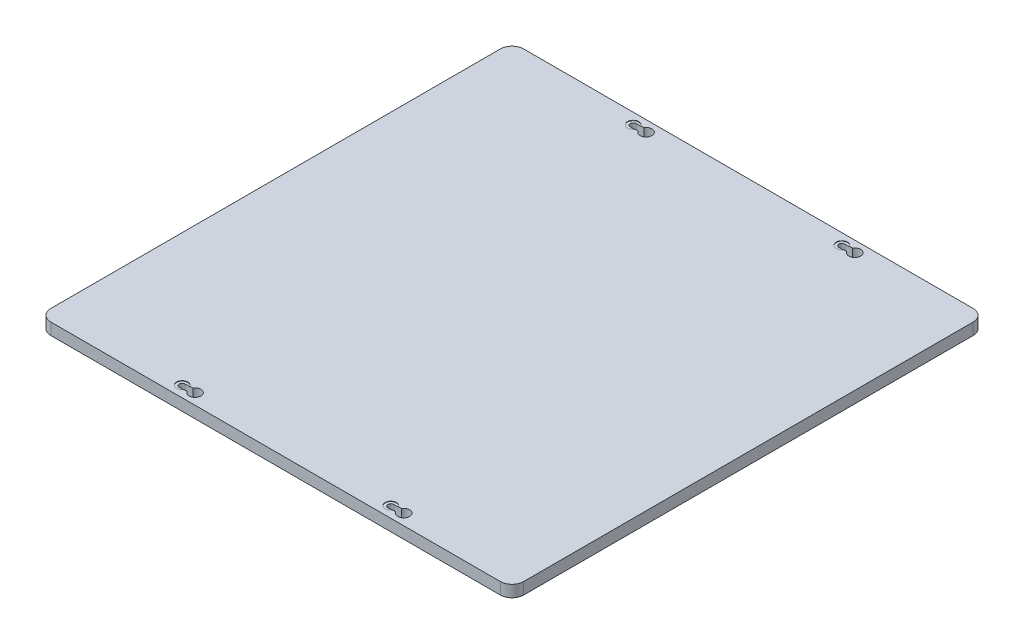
ISO-10303-21;
HEADER;
FILE_DESCRIPTION(('STEP AP214'),'2;1');
FILE_NAME('part.step','',(''),(''),'','','');
FILE_SCHEMA(('AUTOMOTIVE_DESIGN { 1 0 10303 214 1 1 1 1 }'));
ENDSEC;
DATA;
#1=APPLICATION_CONTEXT('core data for automotive mechanical design processes');
#2=APPLICATION_PROTOCOL_DEFINITION('international standard','automotive_design',2000,#1);
#3=PRODUCT_CONTEXT('',#1,'mechanical');
#4=PRODUCT('Part','Part','',(#3));
#5=PRODUCT_RELATED_PRODUCT_CATEGORY('part','',(#4));
#6=PRODUCT_DEFINITION_FORMATION('','',#4);
#7=PRODUCT_DEFINITION_CONTEXT('part definition',#1,'design');
#8=PRODUCT_DEFINITION('design','',#6,#7);
#9=PRODUCT_DEFINITION_SHAPE('','',#8);
#10=(LENGTH_UNIT() NAMED_UNIT(*) SI_UNIT(.MILLI.,.METRE.));
#11=(NAMED_UNIT(*) PLANE_ANGLE_UNIT() SI_UNIT($,.RADIAN.));
#12=(NAMED_UNIT(*) SI_UNIT($,.STERADIAN.) SOLID_ANGLE_UNIT());
#13=UNCERTAINTY_MEASURE_WITH_UNIT(LENGTH_MEASURE(1.E-05),#10,'distance_accuracy_value','');
#14=(GEOMETRIC_REPRESENTATION_CONTEXT(3) GLOBAL_UNCERTAINTY_ASSIGNED_CONTEXT((#13)) GLOBAL_UNIT_ASSIGNED_CONTEXT((#10,
#11,#12)) REPRESENTATION_CONTEXT('',''));
#15=CARTESIAN_POINT('',(0.,0.,0.));
#16=DIRECTION('',(0.,0.,1.));
#17=DIRECTION('',(1.,0.,0.));
#18=AXIS2_PLACEMENT_3D('',#15,#16,#17);
#19=CARTESIAN_POINT('',(-115.,-3.,115.));
#20=DIRECTION('',(0.,1.,0.));
#21=DIRECTION('',(0.,0.,1.));
#22=AXIS2_PLACEMENT_3D('',#19,#20,#21);
#23=CYLINDRICAL_SURFACE('',#22,5.99999999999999);
#24=CARTESIAN_POINT('',(-115.,3.,115.));
#25=DIRECTION('',(0.,1.,0.));
#26=DIRECTION('',(0.,0.,1.));
#27=AXIS2_PLACEMENT_3D('',#24,#25,#26);
#28=CIRCLE('',#27,5.99999999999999);
#29=CARTESIAN_POINT('',(-121.,3.,115.));
#30=VERTEX_POINT('',#29);
#31=CARTESIAN_POINT('',(-115.,3.,121.));
#32=VERTEX_POINT('',#31);
#33=EDGE_CURVE('E280',#30,#32,#28,.T.);
#34=ORIENTED_EDGE('',*,*,#33,.F.);
#35=DIRECTION('',(0.,1.,0.));
#36=VECTOR('',#35,1.);
#37=CARTESIAN_POINT('',(-121.,-3.,115.));
#38=LINE('',#37,#36);
#39=CARTESIAN_POINT('',(-121.,-3.,115.));
#40=VERTEX_POINT('',#39);
#41=EDGE_CURVE('E338',#40,#30,#38,.T.);
#42=ORIENTED_EDGE('',*,*,#41,.F.);
#43=CARTESIAN_POINT('',(-115.,-3.,115.));
#44=DIRECTION('',(0.,1.,0.));
#45=DIRECTION('',(0.,0.,1.));
#46=AXIS2_PLACEMENT_3D('',#43,#44,#45);
#47=CIRCLE('',#46,5.99999999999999);
#48=CARTESIAN_POINT('',(-115.,-3.,121.));
#49=VERTEX_POINT('',#48);
#50=EDGE_CURVE('E290',#40,#49,#47,.T.);
#51=ORIENTED_EDGE('',*,*,#50,.T.);
#52=DIRECTION('',(0.,1.,0.));
#53=VECTOR('',#52,1.);
#54=CARTESIAN_POINT('',(-115.,-3.,121.));
#55=LINE('',#54,#53);
#56=EDGE_CURVE('E315',#49,#32,#55,.T.);
#57=ORIENTED_EDGE('',*,*,#56,.T.);
#58=EDGE_LOOP('',(#34,#42,#51,#57));
#59=FACE_BOUND('',#58,.T.);
#60=ADVANCED_FACE('F35',(#59),#23,.T.);
#61=CARTESIAN_POINT('',(-121.,-3.,-115.));
#62=DIRECTION('',(-1.,0.,0.));
#63=DIRECTION('',(0.,0.,1.));
#64=AXIS2_PLACEMENT_3D('',#61,#62,#63);
#65=PLANE('',#64);
#66=DIRECTION('',(0.,0.,1.));
#67=VECTOR('',#66,1.);
#68=CARTESIAN_POINT('',(-121.,3.,-115.));
#69=LINE('',#68,#67);
#70=CARTESIAN_POINT('',(-121.,3.,-115.));
#71=VERTEX_POINT('',#70);
#72=EDGE_CURVE('E294',#71,#30,#69,.T.);
#73=ORIENTED_EDGE('',*,*,#72,.F.);
#74=DIRECTION('',(0.,1.,0.));
#75=VECTOR('',#74,1.);
#76=CARTESIAN_POINT('',(-121.,-3.,-115.));
#77=LINE('',#76,#75);
#78=CARTESIAN_POINT('',(-121.,-3.,-115.));
#79=VERTEX_POINT('',#78);
#80=EDGE_CURVE('E341',#79,#71,#77,.T.);
#81=ORIENTED_EDGE('',*,*,#80,.F.);
#82=DIRECTION('',(0.,0.,1.));
#83=VECTOR('',#82,1.);
#84=CARTESIAN_POINT('',(-121.,-3.,-115.));
#85=LINE('',#84,#83);
#86=EDGE_CURVE('E312',#79,#40,#85,.T.);
#87=ORIENTED_EDGE('',*,*,#86,.T.);
#88=ORIENTED_EDGE('',*,*,#41,.T.);
#89=EDGE_LOOP('',(#73,#81,#87,#88));
#90=FACE_BOUND('',#89,.T.);
#91=ADVANCED_FACE('F523',(#90),#65,.T.);
#92=CARTESIAN_POINT('',(-115.,-3.,-115.));
#93=DIRECTION('',(0.,1.,0.));
#94=DIRECTION('',(0.,0.,1.));
#95=AXIS2_PLACEMENT_3D('',#92,#93,#94);
#96=CYLINDRICAL_SURFACE('',#95,5.99999999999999);
#97=CARTESIAN_POINT('',(-115.,3.,-115.));
#98=DIRECTION('',(0.,1.,0.));
#99=DIRECTION('',(0.,0.,1.));
#100=AXIS2_PLACEMENT_3D('',#97,#98,#99);
#101=CIRCLE('',#100,5.99999999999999);
#102=CARTESIAN_POINT('',(-115.,3.,-121.));
#103=VERTEX_POINT('',#102);
#104=EDGE_CURVE('E333',#103,#71,#101,.T.);
#105=ORIENTED_EDGE('',*,*,#104,.F.);
#106=DIRECTION('',(0.,1.,0.));
#107=VECTOR('',#106,1.);
#108=CARTESIAN_POINT('',(-115.,-3.,-121.));
#109=LINE('',#108,#107);
#110=CARTESIAN_POINT('',(-115.,-3.,-121.));
#111=VERTEX_POINT('',#110);
#112=EDGE_CURVE('E343',#111,#103,#109,.T.);
#113=ORIENTED_EDGE('',*,*,#112,.F.);
#114=CARTESIAN_POINT('',(-115.,-3.,-115.));
#115=DIRECTION('',(0.,1.,0.));
#116=DIRECTION('',(0.,0.,1.));
#117=AXIS2_PLACEMENT_3D('',#114,#115,#116);
#118=CIRCLE('',#117,5.99999999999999);
#119=EDGE_CURVE('E309',#111,#79,#118,.T.);
#120=ORIENTED_EDGE('',*,*,#119,.T.);
#121=ORIENTED_EDGE('',*,*,#80,.T.);
#122=EDGE_LOOP('',(#105,#113,#120,#121));
#123=FACE_BOUND('',#122,.T.);
#124=ADVANCED_FACE('F528',(#123),#96,.T.);
#125=CARTESIAN_POINT('',(115.,-3.,-121.));
#126=DIRECTION('',(0.,0.,-1.));
#127=DIRECTION('',(-1.,0.,0.));
#128=AXIS2_PLACEMENT_3D('',#125,#126,#127);
#129=PLANE('',#128);
#130=DIRECTION('',(-1.,0.,0.));
#131=VECTOR('',#130,1.);
#132=CARTESIAN_POINT('',(115.,3.,-121.));
#133=LINE('',#132,#131);
#134=CARTESIAN_POINT('',(115.,3.,-121.));
#135=VERTEX_POINT('',#134);
#136=EDGE_CURVE('E330',#135,#103,#133,.T.);
#137=ORIENTED_EDGE('',*,*,#136,.F.);
#138=DIRECTION('',(0.,1.,0.));
#139=VECTOR('',#138,1.);
#140=CARTESIAN_POINT('',(115.,-3.,-121.));
#141=LINE('',#140,#139);
#142=CARTESIAN_POINT('',(115.,-3.,-121.));
#143=VERTEX_POINT('',#142);
#144=EDGE_CURVE('E345',#143,#135,#141,.T.);
#145=ORIENTED_EDGE('',*,*,#144,.F.);
#146=DIRECTION('',(-1.,0.,0.));
#147=VECTOR('',#146,1.);
#148=CARTESIAN_POINT('',(115.,-3.,-121.));
#149=LINE('',#148,#147);
#150=EDGE_CURVE('E306',#143,#111,#149,.T.);
#151=ORIENTED_EDGE('',*,*,#150,.T.);
#152=ORIENTED_EDGE('',*,*,#112,.T.);
#153=EDGE_LOOP('',(#137,#145,#151,#152));
#154=FACE_BOUND('',#153,.T.);
#155=ADVANCED_FACE('F559',(#154),#129,.T.);
#156=CARTESIAN_POINT('',(115.,-3.,-115.));
#157=DIRECTION('',(0.,1.,0.));
#158=DIRECTION('',(0.,0.,1.));
#159=AXIS2_PLACEMENT_3D('',#156,#157,#158);
#160=CYLINDRICAL_SURFACE('',#159,5.99999999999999);
#161=CARTESIAN_POINT('',(115.,3.,-115.));
#162=DIRECTION('',(0.,1.,0.));
#163=DIRECTION('',(0.,0.,1.));
#164=AXIS2_PLACEMENT_3D('',#161,#162,#163);
#165=CIRCLE('',#164,5.99999999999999);
#166=CARTESIAN_POINT('',(121.,3.,-115.));
#167=VERTEX_POINT('',#166);
#168=EDGE_CURVE('E327',#167,#135,#165,.T.);
#169=ORIENTED_EDGE('',*,*,#168,.F.);
#170=DIRECTION('',(0.,1.,0.));
#171=VECTOR('',#170,1.);
#172=CARTESIAN_POINT('',(121.,-3.,-115.));
#173=LINE('',#172,#171);
#174=CARTESIAN_POINT('',(121.,-3.,-115.));
#175=VERTEX_POINT('',#174);
#176=EDGE_CURVE('E347',#175,#167,#173,.T.);
#177=ORIENTED_EDGE('',*,*,#176,.F.);
#178=CARTESIAN_POINT('',(115.,-3.,-115.));
#179=DIRECTION('',(0.,1.,0.));
#180=DIRECTION('',(0.,0.,1.));
#181=AXIS2_PLACEMENT_3D('',#178,#179,#180);
#182=CIRCLE('',#181,5.99999999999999);
#183=EDGE_CURVE('E303',#175,#143,#182,.T.);
#184=ORIENTED_EDGE('',*,*,#183,.T.);
#185=ORIENTED_EDGE('',*,*,#144,.T.);
#186=EDGE_LOOP('',(#169,#177,#184,#185));
#187=FACE_BOUND('',#186,.T.);
#188=ADVANCED_FACE('F556',(#187),#160,.T.);
#189=CARTESIAN_POINT('',(121.,-3.,115.));
#190=DIRECTION('',(1.,0.,0.));
#191=DIRECTION('',(0.,0.,-1.));
#192=AXIS2_PLACEMENT_3D('',#189,#190,#191);
#193=PLANE('',#192);
#194=DIRECTION('',(0.,0.,-1.));
#195=VECTOR('',#194,1.);
#196=CARTESIAN_POINT('',(121.,3.,115.));
#197=LINE('',#196,#195);
#198=CARTESIAN_POINT('',(121.,3.,115.));
#199=VERTEX_POINT('',#198);
#200=EDGE_CURVE('E324',#199,#167,#197,.T.);
#201=ORIENTED_EDGE('',*,*,#200,.F.);
#202=DIRECTION('',(0.,1.,0.));
#203=VECTOR('',#202,1.);
#204=CARTESIAN_POINT('',(121.,-3.,115.));
#205=LINE('',#204,#203);
#206=CARTESIAN_POINT('',(121.,-3.,115.));
#207=VERTEX_POINT('',#206);
#208=EDGE_CURVE('E349',#207,#199,#205,.T.);
#209=ORIENTED_EDGE('',*,*,#208,.F.);
#210=DIRECTION('',(0.,0.,-1.));
#211=VECTOR('',#210,1.);
#212=CARTESIAN_POINT('',(121.,-3.,115.));
#213=LINE('',#212,#211);
#214=EDGE_CURVE('E300',#207,#175,#213,.T.);
#215=ORIENTED_EDGE('',*,*,#214,.T.);
#216=ORIENTED_EDGE('',*,*,#176,.T.);
#217=EDGE_LOOP('',(#201,#209,#215,#216));
#218=FACE_BOUND('',#217,.T.);
#219=ADVANCED_FACE('F552',(#218),#193,.T.);
#220=CARTESIAN_POINT('',(115.,-3.,115.));
#221=DIRECTION('',(0.,1.,0.));
#222=DIRECTION('',(0.,0.,1.));
#223=AXIS2_PLACEMENT_3D('',#220,#221,#222);
#224=CYLINDRICAL_SURFACE('',#223,5.99999999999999);
#225=CARTESIAN_POINT('',(115.,3.,115.));
#226=DIRECTION('',(0.,1.,0.));
#227=DIRECTION('',(0.,0.,1.));
#228=AXIS2_PLACEMENT_3D('',#225,#226,#227);
#229=CIRCLE('',#228,5.99999999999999);
#230=CARTESIAN_POINT('',(115.,3.,121.));
#231=VERTEX_POINT('',#230);
#232=EDGE_CURVE('E321',#231,#199,#229,.T.);
#233=ORIENTED_EDGE('',*,*,#232,.F.);
#234=DIRECTION('',(0.,1.,0.));
#235=VECTOR('',#234,1.);
#236=CARTESIAN_POINT('',(115.,-3.,121.));
#237=LINE('',#236,#235);
#238=CARTESIAN_POINT('',(115.,-3.,121.));
#239=VERTEX_POINT('',#238);
#240=EDGE_CURVE('E351',#239,#231,#237,.T.);
#241=ORIENTED_EDGE('',*,*,#240,.F.);
#242=CARTESIAN_POINT('',(115.,-3.,115.));
#243=DIRECTION('',(0.,1.,0.));
#244=DIRECTION('',(0.,0.,1.));
#245=AXIS2_PLACEMENT_3D('',#242,#243,#244);
#246=CIRCLE('',#245,5.99999999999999);
#247=EDGE_CURVE('E297',#239,#207,#246,.T.);
#248=ORIENTED_EDGE('',*,*,#247,.T.);
#249=ORIENTED_EDGE('',*,*,#208,.T.);
#250=EDGE_LOOP('',(#233,#241,#248,#249));
#251=FACE_BOUND('',#250,.T.);
#252=ADVANCED_FACE('F550',(#251),#224,.T.);
#253=CARTESIAN_POINT('',(-115.,-3.,121.));
#254=DIRECTION('',(0.,0.,1.));
#255=DIRECTION('',(1.,0.,0.));
#256=AXIS2_PLACEMENT_3D('',#253,#254,#255);
#257=PLANE('',#256);
#258=DIRECTION('',(1.,0.,0.));
#259=VECTOR('',#258,1.);
#260=CARTESIAN_POINT('',(-115.,3.,121.));
#261=LINE('',#260,#259);
#262=EDGE_CURVE('E318',#32,#231,#261,.T.);
#263=ORIENTED_EDGE('',*,*,#262,.F.);
#264=ORIENTED_EDGE('',*,*,#56,.F.);
#265=DIRECTION('',(1.,0.,0.));
#266=VECTOR('',#265,1.);
#267=CARTESIAN_POINT('',(-115.,-3.,121.));
#268=LINE('',#267,#266);
#269=EDGE_CURVE('E293',#49,#239,#268,.T.);
#270=ORIENTED_EDGE('',*,*,#269,.T.);
#271=ORIENTED_EDGE('',*,*,#240,.T.);
#272=EDGE_LOOP('',(#263,#264,#270,#271));
#273=FACE_BOUND('',#272,.T.);
#274=ADVANCED_FACE('F546',(#273),#257,.T.);
#275=CARTESIAN_POINT('',(-115.,-3.,115.));
#276=DIRECTION('',(0.,1.,0.));
#277=DIRECTION('',(0.,0.,1.));
#278=AXIS2_PLACEMENT_3D('',#275,#276,#277);
#279=PLANE('',#278);
#280=DIRECTION('',(-1.,0.,-1.8032451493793E-13));
#281=VECTOR('',#280,1.);
#282=CARTESIAN_POINT('',(-49.3980762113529,-3.,116.900000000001));
#283=LINE('',#282,#281);
#284=CARTESIAN_POINT('',(-49.3980762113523,-3.,116.9));
#285=VERTEX_POINT('',#284);
#286=CARTESIAN_POINT('',(-53.4,-3.,116.9));
#287=VERTEX_POINT('',#286);
#288=EDGE_CURVE('E442',#285,#287,#283,.T.);
#289=ORIENTED_EDGE('',*,*,#288,.F.);
#290=CARTESIAN_POINT('',(-46.8,-3.,115.4));
#291=DIRECTION('',(0.,-1.,0.));
#292=DIRECTION('',(0.,0.,-1.));
#293=AXIS2_PLACEMENT_3D('',#290,#291,#292);
#294=CIRCLE('',#293,2.99999999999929);
#295=CARTESIAN_POINT('',(-49.3980762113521,-3.,113.899999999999));
#296=VERTEX_POINT('',#295);
#297=EDGE_CURVE('E458',#296,#285,#294,.T.);
#298=ORIENTED_EDGE('',*,*,#297,.F.);
#299=DIRECTION('',(1.,0.,-1.8032451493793E-13));
#300=VECTOR('',#299,1.);
#301=CARTESIAN_POINT('',(-53.4,-3.,113.9));
#302=LINE('',#301,#300);
#303=CARTESIAN_POINT('',(-53.4,-3.,113.9));
#304=VERTEX_POINT('',#303);
#305=EDGE_CURVE('E446',#304,#296,#302,.T.);
#306=ORIENTED_EDGE('',*,*,#305,.F.);
#307=CARTESIAN_POINT('',(-53.4,-3.,115.4));
#308=DIRECTION('',(0.,-1.,0.));
#309=DIRECTION('',(0.,0.,-1.));
#310=AXIS2_PLACEMENT_3D('',#307,#308,#309);
#311=CIRCLE('',#310,1.5);
#312=EDGE_CURVE('E449',#287,#304,#311,.T.);
#313=ORIENTED_EDGE('',*,*,#312,.F.);
#314=EDGE_LOOP('',(#289,#298,#306,#313));
#315=FACE_BOUND('',#314,.T.);
#316=DIRECTION('',(1.,0.,0.));
#317=VECTOR('',#316,1.);
#318=CARTESIAN_POINT('',(53.4,-3.,116.9));
#319=LINE('',#318,#317);
#320=CARTESIAN_POINT('',(53.4,-3.,116.9));
#321=VERTEX_POINT('',#320);
#322=CARTESIAN_POINT('',(57.4019237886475,-3.,116.9));
#323=VERTEX_POINT('',#322);
#324=EDGE_CURVE('E411',#321,#323,#319,.T.);
#325=ORIENTED_EDGE('',*,*,#324,.T.);
#326=CARTESIAN_POINT('',(60.,-3.,115.4));
#327=DIRECTION('',(0.,-1.,0.));
#328=DIRECTION('',(0.,0.,-1.));
#329=AXIS2_PLACEMENT_3D('',#326,#327,#328);
#330=CIRCLE('',#329,2.99999999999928);
#331=CARTESIAN_POINT('',(57.4019237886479,-3.,113.899999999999));
#332=VERTEX_POINT('',#331);
#333=EDGE_CURVE('E477',#332,#323,#330,.T.);
#334=ORIENTED_EDGE('',*,*,#333,.F.);
#335=DIRECTION('',(-1.,0.,1.8032451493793E-13));
#336=VECTOR('',#335,1.);
#337=CARTESIAN_POINT('',(57.4019237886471,-3.,113.899999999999));
#338=LINE('',#337,#336);
#339=CARTESIAN_POINT('',(53.4,-3.,113.9));
#340=VERTEX_POINT('',#339);
#341=EDGE_CURVE('E421',#332,#340,#338,.T.);
#342=ORIENTED_EDGE('',*,*,#341,.T.);
#343=CARTESIAN_POINT('',(53.4,-3.,115.4));
#344=DIRECTION('',(0.,1.,0.));
#345=DIRECTION('',(0.,0.,1.));
#346=AXIS2_PLACEMENT_3D('',#343,#344,#345);
#347=CIRCLE('',#346,1.5);
#348=EDGE_CURVE('E428',#340,#321,#347,.T.);
#349=ORIENTED_EDGE('',*,*,#348,.T.);
#350=EDGE_LOOP('',(#325,#334,#342,#349));
#351=FACE_BOUND('',#350,.T.);
#352=DIRECTION('',(1.,0.,0.));
#353=VECTOR('',#352,1.);
#354=CARTESIAN_POINT('',(-53.4,-3.,-113.9));
#355=LINE('',#354,#353);
#356=CARTESIAN_POINT('',(-53.4,-3.,-113.9));
#357=VERTEX_POINT('',#356);
#358=CARTESIAN_POINT('',(-49.3980762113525,-3.,-113.9));
#359=VERTEX_POINT('',#358);
#360=EDGE_CURVE('E385',#357,#359,#355,.T.);
#361=ORIENTED_EDGE('',*,*,#360,.T.);
#362=CARTESIAN_POINT('',(-46.8,-3.,-115.4));
#363=DIRECTION('',(0.,-1.,0.));
#364=DIRECTION('',(0.,0.,-1.));
#365=AXIS2_PLACEMENT_3D('',#362,#363,#364);
#366=CIRCLE('',#365,2.99999999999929);
#367=CARTESIAN_POINT('',(-49.3980762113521,-3.,-116.900000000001));
#368=VERTEX_POINT('',#367);
#369=EDGE_CURVE('E496',#368,#359,#366,.T.);
#370=ORIENTED_EDGE('',*,*,#369,.F.);
#371=DIRECTION('',(-1.,0.,1.8032451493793E-13));
#372=VECTOR('',#371,1.);
#373=CARTESIAN_POINT('',(-49.3980762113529,-3.,-116.900000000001));
#374=LINE('',#373,#372);
#375=CARTESIAN_POINT('',(-53.4,-3.,-116.9));
#376=VERTEX_POINT('',#375);
#377=EDGE_CURVE('E395',#368,#376,#374,.T.);
#378=ORIENTED_EDGE('',*,*,#377,.T.);
#379=CARTESIAN_POINT('',(-53.4,-3.,-115.4));
#380=DIRECTION('',(0.,1.,0.));
#381=DIRECTION('',(0.,0.,1.));
#382=AXIS2_PLACEMENT_3D('',#379,#380,#381);
#383=CIRCLE('',#382,1.5);
#384=EDGE_CURVE('E402',#376,#357,#383,.T.);
#385=ORIENTED_EDGE('',*,*,#384,.T.);
#386=EDGE_LOOP('',(#361,#370,#378,#385));
#387=FACE_BOUND('',#386,.T.);
#388=DIRECTION('',(1.,0.,0.));
#389=VECTOR('',#388,1.);
#390=CARTESIAN_POINT('',(53.4,-3.,-113.9));
#391=LINE('',#390,#389);
#392=CARTESIAN_POINT('',(53.4,-3.,-113.9));
#393=VERTEX_POINT('',#392);
#394=CARTESIAN_POINT('',(57.4019237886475,-3.,-113.9));
#395=VERTEX_POINT('',#394);
#396=EDGE_CURVE('E289',#393,#395,#391,.T.);
#397=ORIENTED_EDGE('',*,*,#396,.T.);
#398=CARTESIAN_POINT('',(60.,-3.,-115.4));
#399=DIRECTION('',(0.,-1.,0.));
#400=DIRECTION('',(0.,0.,-1.));
#401=AXIS2_PLACEMENT_3D('',#398,#399,#400);
#402=CIRCLE('',#401,2.99999999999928);
#403=CARTESIAN_POINT('',(57.4019237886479,-3.,-116.900000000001));
#404=VERTEX_POINT('',#403);
#405=EDGE_CURVE('E262',#404,#395,#402,.T.);
#406=ORIENTED_EDGE('',*,*,#405,.F.);
#407=DIRECTION('',(-1.,0.,1.8032451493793E-13));
#408=VECTOR('',#407,1.);
#409=CARTESIAN_POINT('',(57.4019237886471,-3.,-116.900000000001));
#410=LINE('',#409,#408);
#411=CARTESIAN_POINT('',(53.4,-3.,-116.9));
#412=VERTEX_POINT('',#411);
#413=EDGE_CURVE('E268',#404,#412,#410,.T.);
#414=ORIENTED_EDGE('',*,*,#413,.T.);
#415=CARTESIAN_POINT('',(53.4,-3.,-115.4));
#416=DIRECTION('',(0.,1.,0.));
#417=DIRECTION('',(0.,0.,1.));
#418=AXIS2_PLACEMENT_3D('',#415,#416,#417);
#419=CIRCLE('',#418,1.5);
#420=EDGE_CURVE('E272',#412,#393,#419,.T.);
#421=ORIENTED_EDGE('',*,*,#420,.T.);
#422=EDGE_LOOP('',(#397,#406,#414,#421));
#423=FACE_BOUND('',#422,.T.);
#424=ORIENTED_EDGE('',*,*,#50,.F.);
#425=ORIENTED_EDGE('',*,*,#86,.F.);
#426=ORIENTED_EDGE('',*,*,#119,.F.);
#427=ORIENTED_EDGE('',*,*,#150,.F.);
#428=ORIENTED_EDGE('',*,*,#183,.F.);
#429=ORIENTED_EDGE('',*,*,#214,.F.);
#430=ORIENTED_EDGE('',*,*,#247,.F.);
#431=ORIENTED_EDGE('',*,*,#269,.F.);
#432=EDGE_LOOP('',(#424,#425,#426,#427,#428,#429,#430,#431));
#433=FACE_BOUND('',#432,.T.);
#434=ADVANCED_FACE('F540',(#315,#351,#387,#423,#433),#279,.F.);
#435=CARTESIAN_POINT('',(-115.,3.,115.));
#436=DIRECTION('',(0.,1.,0.));
#437=DIRECTION('',(0.,0.,1.));
#438=AXIS2_PLACEMENT_3D('',#435,#436,#437);
#439=PLANE('',#438);
#440=CARTESIAN_POINT('',(53.4,3.,-115.4));
#441=DIRECTION('',(0.,1.,0.));
#442=DIRECTION('',(0.,0.,1.));
#443=AXIS2_PLACEMENT_3D('',#440,#441,#442);
#444=CIRCLE('',#443,2.84999999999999);
#445=CARTESIAN_POINT('',(55.8233241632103,3.,-116.9));
#446=VERTEX_POINT('',#445);
#447=CARTESIAN_POINT('',(55.8233241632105,3.,-113.9));
#448=VERTEX_POINT('',#447);
#449=EDGE_CURVE('E242',#446,#448,#444,.T.);
#450=ORIENTED_EDGE('',*,*,#449,.F.);
#451=DIRECTION('',(-1.,0.,1.8032451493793E-13));
#452=VECTOR('',#451,1.);
#453=CARTESIAN_POINT('',(57.4019237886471,3.,-116.900000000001));
#454=LINE('',#453,#452);
#455=CARTESIAN_POINT('',(57.4019237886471,3.,-116.900000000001));
#456=VERTEX_POINT('',#455);
#457=EDGE_CURVE('E269',#456,#446,#454,.T.);
#458=ORIENTED_EDGE('',*,*,#457,.F.);
#459=CARTESIAN_POINT('',(60.,3.,-115.4));
#460=DIRECTION('',(0.,-1.,0.));
#461=DIRECTION('',(0.,0.,-1.));
#462=AXIS2_PLACEMENT_3D('',#459,#460,#461);
#463=CIRCLE('',#462,2.99999999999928);
#464=CARTESIAN_POINT('',(57.4019237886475,3.,-113.9));
#465=VERTEX_POINT('',#464);
#466=EDGE_CURVE('E267',#456,#465,#463,.T.);
#467=ORIENTED_EDGE('',*,*,#466,.T.);
#468=DIRECTION('',(1.,0.,0.));
#469=VECTOR('',#468,1.);
#470=CARTESIAN_POINT('',(53.4,3.,-113.9));
#471=LINE('',#470,#469);
#472=EDGE_CURVE('E258',#448,#465,#471,.T.);
#473=ORIENTED_EDGE('',*,*,#472,.F.);
#474=EDGE_LOOP('',(#450,#458,#467,#473));
#475=FACE_BOUND('',#474,.T.);
#476=CARTESIAN_POINT('',(-53.4,3.,-115.4));
#477=DIRECTION('',(0.,1.,0.));
#478=DIRECTION('',(0.,0.,1.));
#479=AXIS2_PLACEMENT_3D('',#476,#477,#478);
#480=CIRCLE('',#479,2.84999999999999);
#481=CARTESIAN_POINT('',(-50.9766758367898,3.,-116.9));
#482=VERTEX_POINT('',#481);
#483=CARTESIAN_POINT('',(-50.9766758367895,3.,-113.9));
#484=VERTEX_POINT('',#483);
#485=EDGE_CURVE('E508',#482,#484,#480,.T.);
#486=ORIENTED_EDGE('',*,*,#485,.F.);
#487=DIRECTION('',(-1.,0.,1.8032451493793E-13));
#488=VECTOR('',#487,1.);
#489=CARTESIAN_POINT('',(-49.3980762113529,3.,-116.900000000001));
#490=LINE('',#489,#488);
#491=CARTESIAN_POINT('',(-49.3980762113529,3.,-116.900000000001));
#492=VERTEX_POINT('',#491);
#493=EDGE_CURVE('E396',#492,#482,#490,.T.);
#494=ORIENTED_EDGE('',*,*,#493,.F.);
#495=CARTESIAN_POINT('',(-46.8,3.,-115.4));
#496=DIRECTION('',(0.,-1.,0.));
#497=DIRECTION('',(0.,0.,-1.));
#498=AXIS2_PLACEMENT_3D('',#495,#496,#497);
#499=CIRCLE('',#498,2.99999999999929);
#500=CARTESIAN_POINT('',(-49.3980762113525,3.,-113.9));
#501=VERTEX_POINT('',#500);
#502=EDGE_CURVE('E493',#492,#501,#499,.T.);
#503=ORIENTED_EDGE('',*,*,#502,.T.);
#504=DIRECTION('',(1.,0.,0.));
#505=VECTOR('',#504,1.);
#506=CARTESIAN_POINT('',(-53.4,3.,-113.9));
#507=LINE('',#506,#505);
#508=EDGE_CURVE('E393',#484,#501,#507,.T.);
#509=ORIENTED_EDGE('',*,*,#508,.F.);
#510=EDGE_LOOP('',(#486,#494,#503,#509));
#511=FACE_BOUND('',#510,.T.);
#512=CARTESIAN_POINT('',(53.4,3.,115.4));
#513=DIRECTION('',(0.,1.,0.));
#514=DIRECTION('',(0.,0.,1.));
#515=AXIS2_PLACEMENT_3D('',#512,#513,#514);
#516=CIRCLE('',#515,2.84999999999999);
#517=CARTESIAN_POINT('',(55.8233241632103,3.,113.9));
#518=VERTEX_POINT('',#517);
#519=CARTESIAN_POINT('',(55.8233241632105,3.,116.9));
#520=VERTEX_POINT('',#519);
#521=EDGE_CURVE('E491',#518,#520,#516,.T.);
#522=ORIENTED_EDGE('',*,*,#521,.F.);
#523=DIRECTION('',(-1.,0.,1.8032451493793E-13));
#524=VECTOR('',#523,1.);
#525=CARTESIAN_POINT('',(57.4019237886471,3.,113.899999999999));
#526=LINE('',#525,#524);
#527=CARTESIAN_POINT('',(57.4019237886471,3.,113.899999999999));
#528=VERTEX_POINT('',#527);
#529=EDGE_CURVE('E422',#528,#518,#526,.T.);
#530=ORIENTED_EDGE('',*,*,#529,.F.);
#531=CARTESIAN_POINT('',(60.,3.,115.4));
#532=DIRECTION('',(0.,-1.,0.));
#533=DIRECTION('',(0.,0.,-1.));
#534=AXIS2_PLACEMENT_3D('',#531,#532,#533);
#535=CIRCLE('',#534,2.99999999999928);
#536=CARTESIAN_POINT('',(57.4019237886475,3.,116.9));
#537=VERTEX_POINT('',#536);
#538=EDGE_CURVE('E474',#528,#537,#535,.T.);
#539=ORIENTED_EDGE('',*,*,#538,.T.);
#540=DIRECTION('',(1.,0.,0.));
#541=VECTOR('',#540,1.);
#542=CARTESIAN_POINT('',(53.4,3.,116.9));
#543=LINE('',#542,#541);
#544=EDGE_CURVE('E419',#520,#537,#543,.T.);
#545=ORIENTED_EDGE('',*,*,#544,.F.);
#546=EDGE_LOOP('',(#522,#530,#539,#545));
#547=FACE_BOUND('',#546,.T.);
#548=CARTESIAN_POINT('',(-53.4,3.,115.4));
#549=DIRECTION('',(0.,1.,0.));
#550=DIRECTION('',(0.,0.,1.));
#551=AXIS2_PLACEMENT_3D('',#548,#549,#550);
#552=CIRCLE('',#551,2.84999999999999);
#553=CARTESIAN_POINT('',(-50.9766758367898,3.,113.9));
#554=VERTEX_POINT('',#553);
#555=CARTESIAN_POINT('',(-50.9766758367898,3.,116.9));
#556=VERTEX_POINT('',#555);
#557=EDGE_CURVE('E472',#554,#556,#552,.T.);
#558=ORIENTED_EDGE('',*,*,#557,.F.);
#559=DIRECTION('',(1.,0.,-1.8032451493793E-13));
#560=VECTOR('',#559,1.);
#561=CARTESIAN_POINT('',(-53.4,3.,113.9));
#562=LINE('',#561,#560);
#563=CARTESIAN_POINT('',(-49.3980762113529,3.,113.899999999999));
#564=VERTEX_POINT('',#563);
#565=EDGE_CURVE('E445',#554,#564,#562,.T.);
#566=ORIENTED_EDGE('',*,*,#565,.T.);
#567=CARTESIAN_POINT('',(-46.8,3.,115.4));
#568=DIRECTION('',(0.,-1.,0.));
#569=DIRECTION('',(0.,0.,-1.));
#570=AXIS2_PLACEMENT_3D('',#567,#568,#569);
#571=CIRCLE('',#570,2.99999999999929);
#572=CARTESIAN_POINT('',(-49.3980762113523,3.,116.9));
#573=VERTEX_POINT('',#572);
#574=EDGE_CURVE('E452',#564,#573,#571,.T.);
#575=ORIENTED_EDGE('',*,*,#574,.T.);
#576=DIRECTION('',(-1.,0.,-1.8032451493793E-13));
#577=VECTOR('',#576,1.);
#578=CARTESIAN_POINT('',(-49.3980762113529,3.,116.900000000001));
#579=LINE('',#578,#577);
#580=EDGE_CURVE('E436',#573,#556,#579,.T.);
#581=ORIENTED_EDGE('',*,*,#580,.T.);
#582=EDGE_LOOP('',(#558,#566,#575,#581));
#583=FACE_BOUND('',#582,.T.);
#584=ORIENTED_EDGE('',*,*,#33,.T.);
#585=ORIENTED_EDGE('',*,*,#262,.T.);
#586=ORIENTED_EDGE('',*,*,#232,.T.);
#587=ORIENTED_EDGE('',*,*,#200,.T.);
#588=ORIENTED_EDGE('',*,*,#168,.T.);
#589=ORIENTED_EDGE('',*,*,#136,.T.);
#590=ORIENTED_EDGE('',*,*,#104,.T.);
#591=ORIENTED_EDGE('',*,*,#72,.T.);
#592=EDGE_LOOP('',(#584,#585,#586,#587,#588,#589,#590,#591));
#593=FACE_BOUND('',#592,.T.);
#594=ADVANCED_FACE('F265',(#475,#511,#547,#583,#593),#439,.T.);
#595=CARTESIAN_POINT('',(53.4,-3.,-113.9));
#596=DIRECTION('',(0.,0.,1.));
#597=DIRECTION('',(1.,0.,0.));
#598=AXIS2_PLACEMENT_3D('',#595,#596,#597);
#599=PLANE('',#598);
#600=DIRECTION('',(1.,0.,0.));
#601=VECTOR('',#600,1.);
#602=CARTESIAN_POINT('',(53.4,2.8,-113.9));
#603=LINE('',#602,#601);
#604=CARTESIAN_POINT('',(53.4,2.8,-113.9));
#605=VERTEX_POINT('',#604);
#606=CARTESIAN_POINT('',(55.8233241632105,2.8,-113.9));
#607=VERTEX_POINT('',#606);
#608=EDGE_CURVE('E261',#605,#607,#603,.T.);
#609=ORIENTED_EDGE('',*,*,#608,.T.);
#610=DIRECTION('',(0.,1.,0.));
#611=VECTOR('',#610,1.);
#612=CARTESIAN_POINT('',(55.8233241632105,2.8,-113.9));
#613=LINE('',#612,#611);
#614=EDGE_CURVE('E246',#607,#448,#613,.T.);
#615=ORIENTED_EDGE('',*,*,#614,.T.);
#616=ORIENTED_EDGE('',*,*,#472,.T.);
#617=DIRECTION('',(0.,1.,0.));
#618=VECTOR('',#617,1.);
#619=CARTESIAN_POINT('',(57.4019237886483,-3.,-113.9));
#620=LINE('',#619,#618);
#621=EDGE_CURVE('E278',#395,#465,#620,.T.);
#622=ORIENTED_EDGE('',*,*,#621,.F.);
#623=ORIENTED_EDGE('',*,*,#396,.F.);
#624=DIRECTION('',(0.,1.,0.));
#625=VECTOR('',#624,1.);
#626=CARTESIAN_POINT('',(53.4,-3.,-113.9));
#627=LINE('',#626,#625);
#628=EDGE_CURVE('E281',#393,#605,#627,.T.);
#629=ORIENTED_EDGE('',*,*,#628,.T.);
#630=EDGE_LOOP('',(#609,#615,#616,#622,#623,#629));
#631=FACE_BOUND('',#630,.T.);
#632=ADVANCED_FACE('F256',(#631),#599,.F.);
#633=CARTESIAN_POINT('',(53.4,-3.,-115.4));
#634=DIRECTION('',(0.,1.,0.));
#635=DIRECTION('',(0.,0.,1.));
#636=AXIS2_PLACEMENT_3D('',#633,#634,#635);
#637=CYLINDRICAL_SURFACE('',#636,1.5);
#638=DIRECTION('',(0.,1.,0.));
#639=VECTOR('',#638,1.);
#640=CARTESIAN_POINT('',(53.4,-3.,-116.9));
#641=LINE('',#640,#639);
#642=CARTESIAN_POINT('',(53.4,2.8,-116.9));
#643=VERTEX_POINT('',#642);
#644=EDGE_CURVE('E283',#412,#643,#641,.T.);
#645=ORIENTED_EDGE('',*,*,#644,.T.);
#646=CARTESIAN_POINT('',(53.4,2.8,-115.4));
#647=DIRECTION('',(0.,-1.,0.));
#648=DIRECTION('',(0.,0.,-1.));
#649=AXIS2_PLACEMENT_3D('',#646,#647,#648);
#650=CIRCLE('',#649,1.5);
#651=EDGE_CURVE('E49',#643,#605,#650,.F.);
#652=ORIENTED_EDGE('',*,*,#651,.T.);
#653=ORIENTED_EDGE('',*,*,#628,.F.);
#654=ORIENTED_EDGE('',*,*,#420,.F.);
#655=EDGE_LOOP('',(#645,#652,#653,#654));
#656=FACE_BOUND('',#655,.T.);
#657=ADVANCED_FACE('F374',(#656),#637,.F.);
#658=CARTESIAN_POINT('',(57.4019237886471,-3.,-116.900000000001));
#659=DIRECTION('',(-1.8032451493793E-13,0.,-1.));
#660=DIRECTION('',(-1.,0.,1.8032451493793E-13));
#661=AXIS2_PLACEMENT_3D('',#658,#659,#660);
#662=PLANE('',#661);
#663=ORIENTED_EDGE('',*,*,#457,.T.);
#664=DIRECTION('',(0.,1.,0.));
#665=VECTOR('',#664,1.);
#666=CARTESIAN_POINT('',(55.8233241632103,2.8,-116.9));
#667=LINE('',#666,#665);
#668=CARTESIAN_POINT('',(55.8233241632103,2.8,-116.9));
#669=VERTEX_POINT('',#668);
#670=EDGE_CURVE('E11',#446,#669,#667,.F.);
#671=ORIENTED_EDGE('',*,*,#670,.T.);
#672=DIRECTION('',(-1.,0.,1.8032451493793E-13));
#673=VECTOR('',#672,1.);
#674=CARTESIAN_POINT('',(57.4019237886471,2.8,-116.900000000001));
#675=LINE('',#674,#673);
#676=EDGE_CURVE('E42',#669,#643,#675,.T.);
#677=ORIENTED_EDGE('',*,*,#676,.T.);
#678=ORIENTED_EDGE('',*,*,#644,.F.);
#679=ORIENTED_EDGE('',*,*,#413,.F.);
#680=DIRECTION('',(0.,1.,0.));
#681=VECTOR('',#680,1.);
#682=CARTESIAN_POINT('',(57.4019237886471,-3.,-116.900000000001));
#683=LINE('',#682,#681);
#684=EDGE_CURVE('E286',#404,#456,#683,.T.);
#685=ORIENTED_EDGE('',*,*,#684,.T.);
#686=EDGE_LOOP('',(#663,#671,#677,#678,#679,#685));
#687=FACE_BOUND('',#686,.T.);
#688=ADVANCED_FACE('F371',(#687),#662,.F.);
#689=CARTESIAN_POINT('',(-53.4,-3.,-113.9));
#690=DIRECTION('',(0.,0.,1.));
#691=DIRECTION('',(1.,0.,0.));
#692=AXIS2_PLACEMENT_3D('',#689,#690,#691);
#693=PLANE('',#692);
#694=DIRECTION('',(1.,0.,0.));
#695=VECTOR('',#694,1.);
#696=CARTESIAN_POINT('',(-53.4,2.8,-113.9));
#697=LINE('',#696,#695);
#698=CARTESIAN_POINT('',(-53.4,2.8,-113.9));
#699=VERTEX_POINT('',#698);
#700=CARTESIAN_POINT('',(-50.9766758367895,2.8,-113.9));
#701=VERTEX_POINT('',#700);
#702=EDGE_CURVE('E501',#699,#701,#697,.T.);
#703=ORIENTED_EDGE('',*,*,#702,.T.);
#704=DIRECTION('',(0.,1.,0.));
#705=VECTOR('',#704,1.);
#706=CARTESIAN_POINT('',(-50.9766758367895,2.8,-113.9));
#707=LINE('',#706,#705);
#708=EDGE_CURVE('E498',#701,#484,#707,.T.);
#709=ORIENTED_EDGE('',*,*,#708,.T.);
#710=ORIENTED_EDGE('',*,*,#508,.T.);
#711=DIRECTION('',(0.,1.,0.));
#712=VECTOR('',#711,1.);
#713=CARTESIAN_POINT('',(-49.3980762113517,-3.,-113.9));
#714=LINE('',#713,#712);
#715=EDGE_CURVE('E274',#359,#501,#714,.T.);
#716=ORIENTED_EDGE('',*,*,#715,.F.);
#717=ORIENTED_EDGE('',*,*,#360,.F.);
#718=DIRECTION('',(0.,1.,0.));
#719=VECTOR('',#718,1.);
#720=CARTESIAN_POINT('',(-53.4,-3.,-113.9));
#721=LINE('',#720,#719);
#722=EDGE_CURVE('E388',#357,#699,#721,.T.);
#723=ORIENTED_EDGE('',*,*,#722,.T.);
#724=EDGE_LOOP('',(#703,#709,#710,#716,#717,#723));
#725=FACE_BOUND('',#724,.T.);
#726=ADVANCED_FACE('F588',(#725),#693,.F.);
#727=CARTESIAN_POINT('',(-53.4,-3.,-115.4));
#728=DIRECTION('',(0.,1.,0.));
#729=DIRECTION('',(0.,0.,1.));
#730=AXIS2_PLACEMENT_3D('',#727,#728,#729);
#731=CYLINDRICAL_SURFACE('',#730,1.5);
#732=DIRECTION('',(0.,1.,0.));
#733=VECTOR('',#732,1.);
#734=CARTESIAN_POINT('',(-53.4,-3.,-116.9));
#735=LINE('',#734,#733);
#736=CARTESIAN_POINT('',(-53.4,2.8,-116.9));
#737=VERTEX_POINT('',#736);
#738=EDGE_CURVE('E384',#376,#737,#735,.T.);
#739=ORIENTED_EDGE('',*,*,#738,.T.);
#740=CARTESIAN_POINT('',(-53.4,2.8,-115.4));
#741=DIRECTION('',(0.,-1.,0.));
#742=DIRECTION('',(0.,0.,-1.));
#743=AXIS2_PLACEMENT_3D('',#740,#741,#742);
#744=CIRCLE('',#743,1.5);
#745=EDGE_CURVE('E57',#737,#699,#744,.F.);
#746=ORIENTED_EDGE('',*,*,#745,.T.);
#747=ORIENTED_EDGE('',*,*,#722,.F.);
#748=ORIENTED_EDGE('',*,*,#384,.F.);
#749=EDGE_LOOP('',(#739,#746,#747,#748));
#750=FACE_BOUND('',#749,.T.);
#751=ADVANCED_FACE('F597',(#750),#731,.F.);
#752=CARTESIAN_POINT('',(-49.3980762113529,-3.,-116.900000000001));
#753=DIRECTION('',(-1.8032451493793E-13,0.,-1.));
#754=DIRECTION('',(-1.,0.,1.8032451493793E-13));
#755=AXIS2_PLACEMENT_3D('',#752,#753,#754);
#756=PLANE('',#755);
#757=ORIENTED_EDGE('',*,*,#493,.T.);
#758=DIRECTION('',(0.,1.,0.));
#759=VECTOR('',#758,1.);
#760=CARTESIAN_POINT('',(-50.9766758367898,2.8,-116.9));
#761=LINE('',#760,#759);
#762=CARTESIAN_POINT('',(-50.9766758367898,2.8,-116.9));
#763=VERTEX_POINT('',#762);
#764=EDGE_CURVE('E367',#482,#763,#761,.F.);
#765=ORIENTED_EDGE('',*,*,#764,.T.);
#766=DIRECTION('',(-1.,0.,1.8032451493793E-13));
#767=VECTOR('',#766,1.);
#768=CARTESIAN_POINT('',(-49.3980762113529,2.8,-116.900000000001));
#769=LINE('',#768,#767);
#770=EDGE_CURVE('E365',#763,#737,#769,.T.);
#771=ORIENTED_EDGE('',*,*,#770,.T.);
#772=ORIENTED_EDGE('',*,*,#738,.F.);
#773=ORIENTED_EDGE('',*,*,#377,.F.);
#774=DIRECTION('',(0.,1.,0.));
#775=VECTOR('',#774,1.);
#776=CARTESIAN_POINT('',(-49.3980762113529,-3.,-116.900000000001));
#777=LINE('',#776,#775);
#778=EDGE_CURVE('E381',#368,#492,#777,.T.);
#779=ORIENTED_EDGE('',*,*,#778,.T.);
#780=EDGE_LOOP('',(#757,#765,#771,#772,#773,#779));
#781=FACE_BOUND('',#780,.T.);
#782=ADVANCED_FACE('F593',(#781),#756,.F.);
#783=CARTESIAN_POINT('',(53.4,-3.,116.9));
#784=DIRECTION('',(0.,0.,1.));
#785=DIRECTION('',(1.,0.,0.));
#786=AXIS2_PLACEMENT_3D('',#783,#784,#785);
#787=PLANE('',#786);
#788=DIRECTION('',(1.,0.,0.));
#789=VECTOR('',#788,1.);
#790=CARTESIAN_POINT('',(53.4,2.8,116.9));
#791=LINE('',#790,#789);
#792=CARTESIAN_POINT('',(53.4,2.8,116.9));
#793=VERTEX_POINT('',#792);
#794=CARTESIAN_POINT('',(55.8233241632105,2.8,116.9));
#795=VERTEX_POINT('',#794);
#796=EDGE_CURVE('E482',#793,#795,#791,.T.);
#797=ORIENTED_EDGE('',*,*,#796,.T.);
#798=DIRECTION('',(0.,1.,0.));
#799=VECTOR('',#798,1.);
#800=CARTESIAN_POINT('',(55.8233241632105,2.8,116.9));
#801=LINE('',#800,#799);
#802=EDGE_CURVE('E479',#795,#520,#801,.T.);
#803=ORIENTED_EDGE('',*,*,#802,.T.);
#804=ORIENTED_EDGE('',*,*,#544,.T.);
#805=DIRECTION('',(0.,1.,0.));
#806=VECTOR('',#805,1.);
#807=CARTESIAN_POINT('',(57.4019237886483,-3.,116.9));
#808=LINE('',#807,#806);
#809=EDGE_CURVE('E399',#323,#537,#808,.T.);
#810=ORIENTED_EDGE('',*,*,#809,.F.);
#811=ORIENTED_EDGE('',*,*,#324,.F.);
#812=DIRECTION('',(0.,1.,0.));
#813=VECTOR('',#812,1.);
#814=CARTESIAN_POINT('',(53.4,-3.,116.9));
#815=LINE('',#814,#813);
#816=EDGE_CURVE('E414',#321,#793,#815,.T.);
#817=ORIENTED_EDGE('',*,*,#816,.T.);
#818=EDGE_LOOP('',(#797,#803,#804,#810,#811,#817));
#819=FACE_BOUND('',#818,.T.);
#820=ADVANCED_FACE('F596',(#819),#787,.F.);
#821=CARTESIAN_POINT('',(53.4,-3.,115.4));
#822=DIRECTION('',(0.,1.,0.));
#823=DIRECTION('',(0.,0.,1.));
#824=AXIS2_PLACEMENT_3D('',#821,#822,#823);
#825=CYLINDRICAL_SURFACE('',#824,1.5);
#826=DIRECTION('',(0.,1.,0.));
#827=VECTOR('',#826,1.);
#828=CARTESIAN_POINT('',(53.4,-3.,113.9));
#829=LINE('',#828,#827);
#830=CARTESIAN_POINT('',(53.4,2.8,113.9));
#831=VERTEX_POINT('',#830);
#832=EDGE_CURVE('E410',#340,#831,#829,.T.);
#833=ORIENTED_EDGE('',*,*,#832,.T.);
#834=CARTESIAN_POINT('',(53.4,2.8,115.4));
#835=DIRECTION('',(0.,-1.,0.));
#836=DIRECTION('',(0.,0.,-1.));
#837=AXIS2_PLACEMENT_3D('',#834,#835,#836);
#838=CIRCLE('',#837,1.5);
#839=EDGE_CURVE('E485',#831,#793,#838,.F.);
#840=ORIENTED_EDGE('',*,*,#839,.T.);
#841=ORIENTED_EDGE('',*,*,#816,.F.);
#842=ORIENTED_EDGE('',*,*,#348,.F.);
#843=EDGE_LOOP('',(#833,#840,#841,#842));
#844=FACE_BOUND('',#843,.T.);
#845=ADVANCED_FACE('F609',(#844),#825,.F.);
#846=CARTESIAN_POINT('',(57.4019237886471,-3.,113.899999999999));
#847=DIRECTION('',(-1.8032451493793E-13,0.,-1.));
#848=DIRECTION('',(-1.,0.,1.8032451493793E-13));
#849=AXIS2_PLACEMENT_3D('',#846,#847,#848);
#850=PLANE('',#849);
#851=ORIENTED_EDGE('',*,*,#529,.T.);
#852=DIRECTION('',(0.,1.,0.));
#853=VECTOR('',#852,1.);
#854=CARTESIAN_POINT('',(55.8233241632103,2.8,113.9));
#855=LINE('',#854,#853);
#856=CARTESIAN_POINT('',(55.8233241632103,2.8,113.9));
#857=VERTEX_POINT('',#856);
#858=EDGE_CURVE('E362',#518,#857,#855,.F.);
#859=ORIENTED_EDGE('',*,*,#858,.T.);
#860=DIRECTION('',(-1.,0.,1.8032451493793E-13));
#861=VECTOR('',#860,1.);
#862=CARTESIAN_POINT('',(57.4019237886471,2.8,113.899999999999));
#863=LINE('',#862,#861);
#864=EDGE_CURVE('E359',#857,#831,#863,.T.);
#865=ORIENTED_EDGE('',*,*,#864,.T.);
#866=ORIENTED_EDGE('',*,*,#832,.F.);
#867=ORIENTED_EDGE('',*,*,#341,.F.);
#868=DIRECTION('',(0.,1.,0.));
#869=VECTOR('',#868,1.);
#870=CARTESIAN_POINT('',(57.4019237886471,-3.,113.899999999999));
#871=LINE('',#870,#869);
#872=EDGE_CURVE('E407',#332,#528,#871,.T.);
#873=ORIENTED_EDGE('',*,*,#872,.T.);
#874=EDGE_LOOP('',(#851,#859,#865,#866,#867,#873));
#875=FACE_BOUND('',#874,.T.);
#876=ADVANCED_FACE('F605',(#875),#850,.F.);
#877=CARTESIAN_POINT('',(-53.4,3.,115.4));
#878=DIRECTION('',(0.,-1.,0.));
#879=DIRECTION('',(0.,0.,-1.));
#880=AXIS2_PLACEMENT_3D('',#877,#878,#879);
#881=CYLINDRICAL_SURFACE('',#880,1.5);
#882=DIRECTION('',(0.,-1.,0.));
#883=VECTOR('',#882,1.);
#884=CARTESIAN_POINT('',(-53.4,3.,113.9));
#885=LINE('',#884,#883);
#886=CARTESIAN_POINT('',(-53.4,2.8,113.9));
#887=VERTEX_POINT('',#886);
#888=EDGE_CURVE('E433',#887,#304,#885,.T.);
#889=ORIENTED_EDGE('',*,*,#888,.F.);
#890=CARTESIAN_POINT('',(-53.4,2.8,115.4));
#891=DIRECTION('',(0.,-1.,0.));
#892=DIRECTION('',(0.,0.,-1.));
#893=AXIS2_PLACEMENT_3D('',#890,#891,#892);
#894=CIRCLE('',#893,1.5);
#895=CARTESIAN_POINT('',(-53.4,2.8,116.9));
#896=VERTEX_POINT('',#895);
#897=EDGE_CURVE('E466',#887,#896,#894,.F.);
#898=ORIENTED_EDGE('',*,*,#897,.T.);
#899=DIRECTION('',(0.,-1.,0.));
#900=VECTOR('',#899,1.);
#901=CARTESIAN_POINT('',(-53.4,3.,116.9));
#902=LINE('',#901,#900);
#903=EDGE_CURVE('E425',#896,#287,#902,.T.);
#904=ORIENTED_EDGE('',*,*,#903,.T.);
#905=ORIENTED_EDGE('',*,*,#312,.T.);
#906=EDGE_LOOP('',(#889,#898,#904,#905));
#907=FACE_BOUND('',#906,.T.);
#908=ADVANCED_FACE('F608',(#907),#881,.F.);
#909=CARTESIAN_POINT('',(-49.3980762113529,3.,116.900000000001));
#910=DIRECTION('',(-1.8032451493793E-13,0.,1.));
#911=DIRECTION('',(1.,0.,1.8032451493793E-13));
#912=AXIS2_PLACEMENT_3D('',#909,#910,#911);
#913=PLANE('',#912);
#914=DIRECTION('',(1.,0.,1.8032451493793E-13));
#915=VECTOR('',#914,1.);
#916=CARTESIAN_POINT('',(-49.3980762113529,2.8,116.900000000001));
#917=LINE('',#916,#915);
#918=CARTESIAN_POINT('',(-50.9766758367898,2.8,116.9));
#919=VERTEX_POINT('',#918);
#920=EDGE_CURVE('E463',#896,#919,#917,.T.);
#921=ORIENTED_EDGE('',*,*,#920,.T.);
#922=DIRECTION('',(0.,1.,0.));
#923=VECTOR('',#922,1.);
#924=CARTESIAN_POINT('',(-50.9766758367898,2.8,116.9));
#925=LINE('',#924,#923);
#926=EDGE_CURVE('E460',#919,#556,#925,.T.);
#927=ORIENTED_EDGE('',*,*,#926,.T.);
#928=ORIENTED_EDGE('',*,*,#580,.F.);
#929=DIRECTION('',(0.,-1.,0.));
#930=VECTOR('',#929,1.);
#931=CARTESIAN_POINT('',(-49.3980762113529,3.,116.900000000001));
#932=LINE('',#931,#930);
#933=EDGE_CURVE('E438',#573,#285,#932,.T.);
#934=ORIENTED_EDGE('',*,*,#933,.T.);
#935=ORIENTED_EDGE('',*,*,#288,.T.);
#936=ORIENTED_EDGE('',*,*,#903,.F.);
#937=EDGE_LOOP('',(#921,#927,#928,#934,#935,#936));
#938=FACE_BOUND('',#937,.T.);
#939=ADVANCED_FACE('F619',(#938),#913,.F.);
#940=CARTESIAN_POINT('',(-53.4,3.,113.9));
#941=DIRECTION('',(-1.8032451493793E-13,0.,-1.));
#942=DIRECTION('',(-1.,0.,1.8032451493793E-13));
#943=AXIS2_PLACEMENT_3D('',#940,#941,#942);
#944=PLANE('',#943);
#945=ORIENTED_EDGE('',*,*,#565,.F.);
#946=DIRECTION('',(0.,1.,0.));
#947=VECTOR('',#946,1.);
#948=CARTESIAN_POINT('',(-50.9766758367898,2.8,113.9));
#949=LINE('',#948,#947);
#950=CARTESIAN_POINT('',(-50.9766758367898,2.8,113.9));
#951=VERTEX_POINT('',#950);
#952=EDGE_CURVE('E356',#554,#951,#949,.F.);
#953=ORIENTED_EDGE('',*,*,#952,.T.);
#954=DIRECTION('',(-1.,0.,1.8032451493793E-13));
#955=VECTOR('',#954,1.);
#956=CARTESIAN_POINT('',(-53.4,2.8,113.9));
#957=LINE('',#956,#955);
#958=EDGE_CURVE('E340',#951,#887,#957,.T.);
#959=ORIENTED_EDGE('',*,*,#958,.T.);
#960=ORIENTED_EDGE('',*,*,#888,.T.);
#961=ORIENTED_EDGE('',*,*,#305,.T.);
#962=DIRECTION('',(0.,-1.,0.));
#963=VECTOR('',#962,1.);
#964=CARTESIAN_POINT('',(-49.3980762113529,3.,113.899999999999));
#965=LINE('',#964,#963);
#966=EDGE_CURVE('E435',#564,#296,#965,.T.);
#967=ORIENTED_EDGE('',*,*,#966,.F.);
#968=EDGE_LOOP('',(#945,#953,#959,#960,#961,#967));
#969=FACE_BOUND('',#968,.T.);
#970=ADVANCED_FACE('F621',(#969),#944,.F.);
#971=CARTESIAN_POINT('',(-46.8,3.,115.4));
#972=DIRECTION('',(0.,-1.,0.));
#973=DIRECTION('',(0.,0.,-1.));
#974=AXIS2_PLACEMENT_3D('',#971,#972,#973);
#975=CYLINDRICAL_SURFACE('',#974,2.99999999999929);
#976=ORIENTED_EDGE('',*,*,#574,.F.);
#977=ORIENTED_EDGE('',*,*,#966,.T.);
#978=ORIENTED_EDGE('',*,*,#297,.T.);
#979=ORIENTED_EDGE('',*,*,#933,.F.);
#980=EDGE_LOOP('',(#976,#977,#978,#979));
#981=FACE_BOUND('',#980,.T.);
#982=ADVANCED_FACE('F624',(#981),#975,.F.);
#983=CARTESIAN_POINT('',(-53.4,2.8,115.4));
#984=DIRECTION('',(0.,1.,0.));
#985=DIRECTION('',(0.,0.,1.));
#986=AXIS2_PLACEMENT_3D('',#983,#984,#985);
#987=CYLINDRICAL_SURFACE('',#986,2.84999999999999);
#988=CARTESIAN_POINT('',(-53.4,2.8,115.4));
#989=DIRECTION('',(0.,1.,0.));
#990=DIRECTION('',(0.,0.,1.));
#991=AXIS2_PLACEMENT_3D('',#988,#989,#990);
#992=CIRCLE('',#991,2.84999999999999);
#993=EDGE_CURVE('E469',#951,#919,#992,.T.);
#994=ORIENTED_EDGE('',*,*,#993,.F.);
#995=ORIENTED_EDGE('',*,*,#952,.F.);
#996=ORIENTED_EDGE('',*,*,#557,.T.);
#997=ORIENTED_EDGE('',*,*,#926,.F.);
#998=EDGE_LOOP('',(#994,#995,#996,#997));
#999=FACE_BOUND('',#998,.T.);
#1000=ADVANCED_FACE('F631',(#999),#987,.F.);
#1001=CARTESIAN_POINT('',(-50.55,2.8,115.4));
#1002=DIRECTION('',(0.,-1.,0.));
#1003=DIRECTION('',(0.,0.,-1.));
#1004=AXIS2_PLACEMENT_3D('',#1001,#1002,#1003);
#1005=PLANE('',#1004);
#1006=ORIENTED_EDGE('',*,*,#897,.F.);
#1007=ORIENTED_EDGE('',*,*,#958,.F.);
#1008=ORIENTED_EDGE('',*,*,#993,.T.);
#1009=ORIENTED_EDGE('',*,*,#920,.F.);
#1010=EDGE_LOOP('',(#1006,#1007,#1008,#1009));
#1011=FACE_BOUND('',#1010,.T.);
#1012=ADVANCED_FACE('F635',(#1011),#1005,.F.);
#1013=CARTESIAN_POINT('',(60.,3.,115.4));
#1014=DIRECTION('',(0.,-1.,0.));
#1015=DIRECTION('',(0.,0.,-1.));
#1016=AXIS2_PLACEMENT_3D('',#1013,#1014,#1015);
#1017=CYLINDRICAL_SURFACE('',#1016,2.99999999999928);
#1018=ORIENTED_EDGE('',*,*,#538,.F.);
#1019=ORIENTED_EDGE('',*,*,#872,.F.);
#1020=ORIENTED_EDGE('',*,*,#333,.T.);
#1021=ORIENTED_EDGE('',*,*,#809,.T.);
#1022=EDGE_LOOP('',(#1018,#1019,#1020,#1021));
#1023=FACE_BOUND('',#1022,.T.);
#1024=ADVANCED_FACE('F639',(#1023),#1017,.F.);
#1025=CARTESIAN_POINT('',(53.4,2.8,115.4));
#1026=DIRECTION('',(0.,1.,0.));
#1027=DIRECTION('',(0.,0.,1.));
#1028=AXIS2_PLACEMENT_3D('',#1025,#1026,#1027);
#1029=CYLINDRICAL_SURFACE('',#1028,2.84999999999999);
#1030=CARTESIAN_POINT('',(53.4,2.8,115.4));
#1031=DIRECTION('',(0.,1.,0.));
#1032=DIRECTION('',(0.,0.,1.));
#1033=AXIS2_PLACEMENT_3D('',#1030,#1031,#1032);
#1034=CIRCLE('',#1033,2.84999999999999);
#1035=EDGE_CURVE('E488',#857,#795,#1034,.T.);
#1036=ORIENTED_EDGE('',*,*,#1035,.F.);
#1037=ORIENTED_EDGE('',*,*,#858,.F.);
#1038=ORIENTED_EDGE('',*,*,#521,.T.);
#1039=ORIENTED_EDGE('',*,*,#802,.F.);
#1040=EDGE_LOOP('',(#1036,#1037,#1038,#1039));
#1041=FACE_BOUND('',#1040,.T.);
#1042=ADVANCED_FACE('F643',(#1041),#1029,.F.);
#1043=CARTESIAN_POINT('',(56.25,2.8,115.4));
#1044=DIRECTION('',(0.,-1.,0.));
#1045=DIRECTION('',(0.,0.,-1.));
#1046=AXIS2_PLACEMENT_3D('',#1043,#1044,#1045);
#1047=PLANE('',#1046);
#1048=ORIENTED_EDGE('',*,*,#839,.F.);
#1049=ORIENTED_EDGE('',*,*,#864,.F.);
#1050=ORIENTED_EDGE('',*,*,#1035,.T.);
#1051=ORIENTED_EDGE('',*,*,#796,.F.);
#1052=EDGE_LOOP('',(#1048,#1049,#1050,#1051));
#1053=FACE_BOUND('',#1052,.T.);
#1054=ADVANCED_FACE('F647',(#1053),#1047,.F.);
#1055=CARTESIAN_POINT('',(-46.8,3.,-115.4));
#1056=DIRECTION('',(0.,-1.,0.));
#1057=DIRECTION('',(0.,0.,-1.));
#1058=AXIS2_PLACEMENT_3D('',#1055,#1056,#1057);
#1059=CYLINDRICAL_SURFACE('',#1058,2.99999999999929);
#1060=ORIENTED_EDGE('',*,*,#502,.F.);
#1061=ORIENTED_EDGE('',*,*,#778,.F.);
#1062=ORIENTED_EDGE('',*,*,#369,.T.);
#1063=ORIENTED_EDGE('',*,*,#715,.T.);
#1064=EDGE_LOOP('',(#1060,#1061,#1062,#1063));
#1065=FACE_BOUND('',#1064,.T.);
#1066=ADVANCED_FACE('F651',(#1065),#1059,.F.);
#1067=CARTESIAN_POINT('',(-53.4,2.8,-115.4));
#1068=DIRECTION('',(0.,1.,0.));
#1069=DIRECTION('',(0.,0.,1.));
#1070=AXIS2_PLACEMENT_3D('',#1067,#1068,#1069);
#1071=CYLINDRICAL_SURFACE('',#1070,2.84999999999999);
#1072=CARTESIAN_POINT('',(-53.4,2.8,-115.4));
#1073=DIRECTION('',(0.,1.,0.));
#1074=DIRECTION('',(0.,0.,1.));
#1075=AXIS2_PLACEMENT_3D('',#1072,#1073,#1074);
#1076=CIRCLE('',#1075,2.84999999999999);
#1077=EDGE_CURVE('E505',#763,#701,#1076,.T.);
#1078=ORIENTED_EDGE('',*,*,#1077,.F.);
#1079=ORIENTED_EDGE('',*,*,#764,.F.);
#1080=ORIENTED_EDGE('',*,*,#485,.T.);
#1081=ORIENTED_EDGE('',*,*,#708,.F.);
#1082=EDGE_LOOP('',(#1078,#1079,#1080,#1081));
#1083=FACE_BOUND('',#1082,.T.);
#1084=ADVANCED_FACE('F655',(#1083),#1071,.F.);
#1085=CARTESIAN_POINT('',(-50.55,2.8,-115.4));
#1086=DIRECTION('',(0.,-1.,0.));
#1087=DIRECTION('',(0.,0.,-1.));
#1088=AXIS2_PLACEMENT_3D('',#1085,#1086,#1087);
#1089=PLANE('',#1088);
#1090=ORIENTED_EDGE('',*,*,#745,.F.);
#1091=ORIENTED_EDGE('',*,*,#770,.F.);
#1092=ORIENTED_EDGE('',*,*,#1077,.T.);
#1093=ORIENTED_EDGE('',*,*,#702,.F.);
#1094=EDGE_LOOP('',(#1090,#1091,#1092,#1093));
#1095=FACE_BOUND('',#1094,.T.);
#1096=ADVANCED_FACE('F659',(#1095),#1089,.F.);
#1097=CARTESIAN_POINT('',(60.,3.,-115.4));
#1098=DIRECTION('',(0.,-1.,0.));
#1099=DIRECTION('',(0.,0.,-1.));
#1100=AXIS2_PLACEMENT_3D('',#1097,#1098,#1099);
#1101=CYLINDRICAL_SURFACE('',#1100,2.99999999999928);
#1102=ORIENTED_EDGE('',*,*,#466,.F.);
#1103=ORIENTED_EDGE('',*,*,#684,.F.);
#1104=ORIENTED_EDGE('',*,*,#405,.T.);
#1105=ORIENTED_EDGE('',*,*,#621,.T.);
#1106=EDGE_LOOP('',(#1102,#1103,#1104,#1105));
#1107=FACE_BOUND('',#1106,.T.);
#1108=ADVANCED_FACE('F520',(#1107),#1101,.F.);
#1109=CARTESIAN_POINT('',(53.4,2.8,-115.4));
#1110=DIRECTION('',(0.,1.,0.));
#1111=DIRECTION('',(0.,0.,1.));
#1112=AXIS2_PLACEMENT_3D('',#1109,#1110,#1111);
#1113=CYLINDRICAL_SURFACE('',#1112,2.84999999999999);
#1114=CARTESIAN_POINT('',(53.4,2.8,-115.4));
#1115=DIRECTION('',(0.,1.,0.));
#1116=DIRECTION('',(0.,0.,1.));
#1117=AXIS2_PLACEMENT_3D('',#1114,#1115,#1116);
#1118=CIRCLE('',#1117,2.84999999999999);
#1119=EDGE_CURVE('E252',#669,#607,#1118,.T.);
#1120=ORIENTED_EDGE('',*,*,#1119,.F.);
#1121=ORIENTED_EDGE('',*,*,#670,.F.);
#1122=ORIENTED_EDGE('',*,*,#449,.T.);
#1123=ORIENTED_EDGE('',*,*,#614,.F.);
#1124=EDGE_LOOP('',(#1120,#1121,#1122,#1123));
#1125=FACE_BOUND('',#1124,.T.);
#1126=ADVANCED_FACE('F245',(#1125),#1113,.F.);
#1127=CARTESIAN_POINT('',(56.25,2.8,-115.4));
#1128=DIRECTION('',(0.,-1.,0.));
#1129=DIRECTION('',(0.,0.,-1.));
#1130=AXIS2_PLACEMENT_3D('',#1127,#1128,#1129);
#1131=PLANE('',#1130);
#1132=ORIENTED_EDGE('',*,*,#651,.F.);
#1133=ORIENTED_EDGE('',*,*,#676,.F.);
#1134=ORIENTED_EDGE('',*,*,#1119,.T.);
#1135=ORIENTED_EDGE('',*,*,#608,.F.);
#1136=EDGE_LOOP('',(#1132,#1133,#1134,#1135));
#1137=FACE_BOUND('',#1136,.T.);
#1138=ADVANCED_FACE('F514',(#1137),#1131,.F.);
#1139=CLOSED_SHELL('',(#60,#91,#124,#155,#188,#219,#252,#274,#434,#594,#632,#657,#688,#726,#751,
#782,#820,#845,#876,#908,#939,#970,#982,#1000,#1012,#1024,#1042,#1054,#1066,#1084,#1096,#1108,
#1126,#1138));
#1140=MANIFOLD_SOLID_BREP('B2',#1139);
#1141=ADVANCED_BREP_SHAPE_REPRESENTATION('',(#18,#1140),#14);
#1142=SHAPE_DEFINITION_REPRESENTATION(#9,#1141);
ENDSEC;
END-ISO-10303-21;
